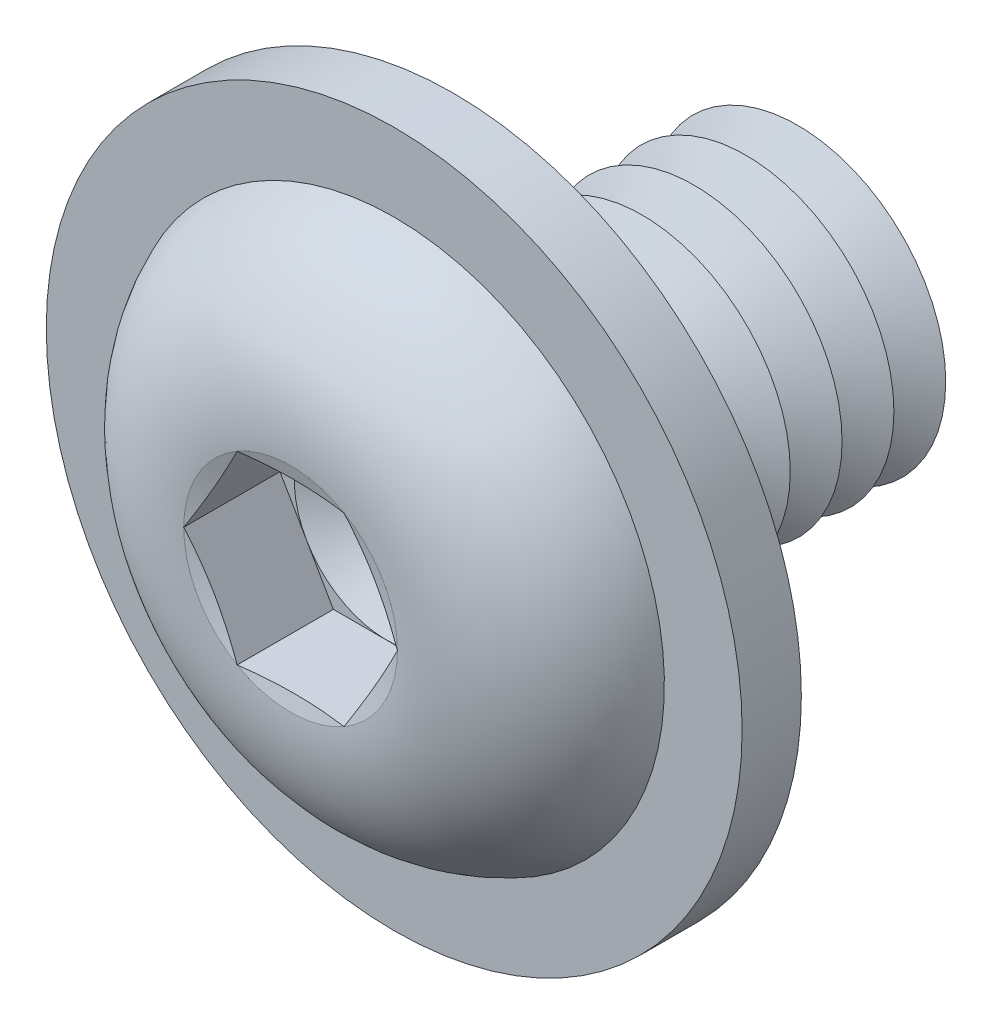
from build123d import *

# Parameters (mm, degrees)
FILLET1_R           = 0.35
LPATTERN1_COUNT     = 7
LPATTERN1_PITCH     = 0.7
CUT_EXTRUDE1_DEPTH  = 1.3
SKETCH5_R           = 4.7
SKETCH5_R_2         = 2.35
BOSS_EXTRUDE1_DEPTH = 0.8


with BuildPart() as part:
    # Sketch1 → Revolve1 (revolve)
    with BuildSketch(Plane(origin=(0, 0, 0), x_dir=(0, 0, -1), z_dir=(1, 0, 0)), mode=Mode.PRIVATE) as revolve1_sk:
        with BuildLine():
            Line((0, 2), (0, 3.8))
            ThreePointArc((0, 3.8), (-1.611961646, 3.099623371), (-2.2, 1.443375))
            Line((-2.2, 1.443375), (-2.006624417, 0.7216875))
            Line((-2.006624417, 0.7216875), (-2.2, 0.7216875))
            Line((-2.2, 0.7216875), (-2.2, 0))
            Line((-2.2, 0), (5, 0))
            Line((5, 0), (5, 2))
            Line((5, 2), (0, 2))
        make_face()
    revolve(revolve1_sk.sketch.rotate(Axis((0, 0, -5), (0, 0, 1)), 90), axis=Axis((0, 0, -5), (0, 0, 1)))

    # Fillet1
    fillet1_edges = [part.edges().sort_by_distance(p)[0] for p in [
        (2, 0, 0),
    ]]
    fillet(fillet1_edges, radius=FILLET1_R)

    # Sketch2 → Cut-Revolve1 (revolve, cut)
    with BuildSketch(Plane(origin=(0, 0, 0), x_dir=(0, 0, -1), z_dir=(1, 0, 0)), mode=Mode.PRIVATE) as cut_revolve1_sk:
        Polygon((4.65, 2), (5.35, 2), (5, 1.393782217), align=None)
    cut_revolve1 = revolve(cut_revolve1_sk.sketch.rotate(Axis((0, 0, -5), (0, 0, -1)), 270), axis=Axis((0, 0, -5), (0, 0, -1)), mode=Mode.SUBTRACT)

    # LPattern1: Cut-Revolve1 ×7
    with Locations(*[(0, 0, i * LPATTERN1_PITCH) for i in range(1, LPATTERN1_COUNT)]):
        add(cut_revolve1, mode=Mode.SUBTRACT)

    # Sketch3 → Cut-Extrude1 (cut)
    with BuildSketch(Plane.XY.offset(2.2)):
        Polygon((0.7216875, 1.249999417), (-0.7216875, 1.249999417), (-1.443375, 0), (-0.7216875, -1.249999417), (0.7216875, -1.249999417), (1.443375, 0), align=None)
    extrude(amount=-CUT_EXTRUDE1_DEPTH, mode=Mode.SUBTRACT)

    # Cut-Extrude2 cone 1 section (on through the dimple's axis) → Cut-Extrude2 (revolve, cut)
    with BuildSketch(Plane(origin=(0, 0, 0.9), x_dir=(0, -1, 0), z_dir=(1, 0, 0))):
        Polygon((0, 0), (1.249999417, 0), (0, 0.7216875), align=None)
    revolve(axis=Axis((0, 0, 0.9), (0, 0, -1)), mode=Mode.SUBTRACT)

    # Sketch5 → Boss-Extrude1 (add)
    with BuildSketch(Plane(origin=(0, 0, 0), x_dir=(-1, 0, 0), z_dir=(0, 0, -1))):
        with Locations(Location((0, 0, 0), (0, 0, 90))):
            Circle(SKETCH5_R)
        Circle(SKETCH5_R_2, mode=Mode.SUBTRACT)
    extrude(amount=-BOSS_EXTRUDE1_DEPTH)


solid = part.part
